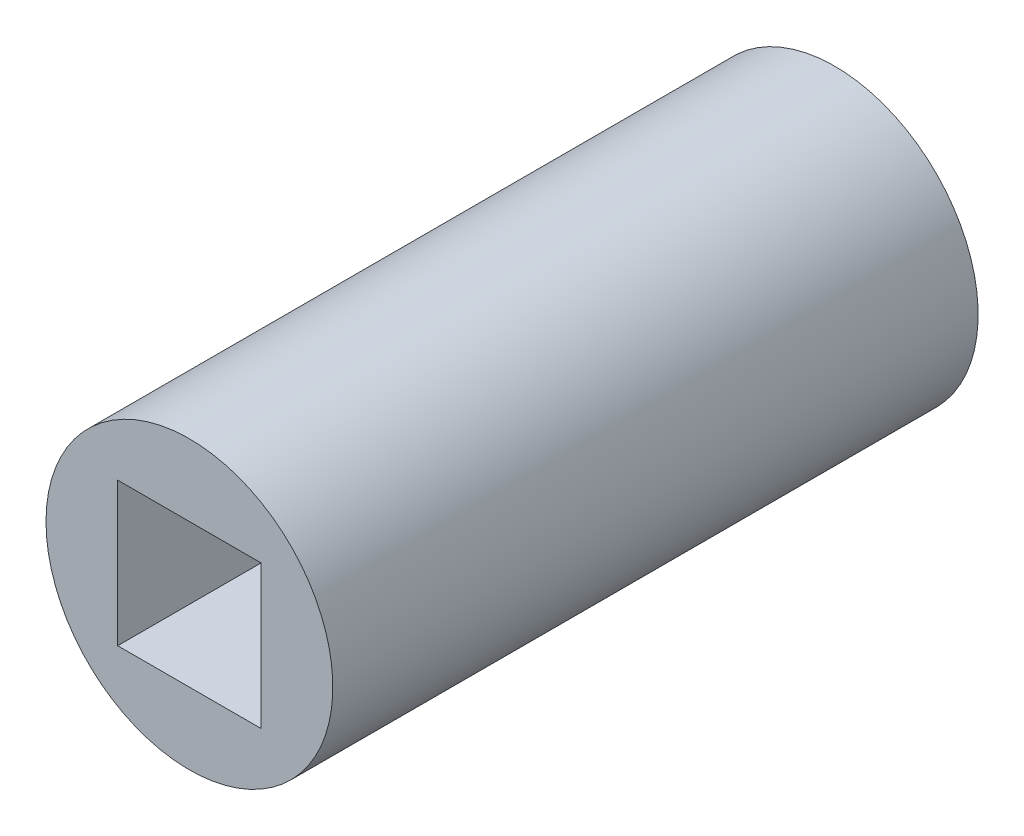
ISO-10303-21;
HEADER;
FILE_DESCRIPTION(('STEP AP214'),'2;1');
FILE_NAME('part.step','',(''),(''),'','','');
FILE_SCHEMA(('AUTOMOTIVE_DESIGN { 1 0 10303 214 1 1 1 1 }'));
ENDSEC;
DATA;
#1=APPLICATION_CONTEXT('core data for automotive mechanical design processes');
#2=APPLICATION_PROTOCOL_DEFINITION('international standard','automotive_design',2000,#1);
#3=PRODUCT_CONTEXT('',#1,'mechanical');
#4=PRODUCT('Part','Part','',(#3));
#5=PRODUCT_RELATED_PRODUCT_CATEGORY('part','',(#4));
#6=PRODUCT_DEFINITION_FORMATION('','',#4);
#7=PRODUCT_DEFINITION_CONTEXT('part definition',#1,'design');
#8=PRODUCT_DEFINITION('design','',#6,#7);
#9=PRODUCT_DEFINITION_SHAPE('','',#8);
#10=(LENGTH_UNIT() NAMED_UNIT(*) SI_UNIT(.MILLI.,.METRE.));
#11=(NAMED_UNIT(*) PLANE_ANGLE_UNIT() SI_UNIT($,.RADIAN.));
#12=(NAMED_UNIT(*) SI_UNIT($,.STERADIAN.) SOLID_ANGLE_UNIT());
#13=UNCERTAINTY_MEASURE_WITH_UNIT(LENGTH_MEASURE(1.E-05),#10,'distance_accuracy_value','');
#14=(GEOMETRIC_REPRESENTATION_CONTEXT(3) GLOBAL_UNCERTAINTY_ASSIGNED_CONTEXT((#13)) GLOBAL_UNIT_ASSIGNED_CONTEXT((#10,
#11,#12)) REPRESENTATION_CONTEXT('',''));
#15=CARTESIAN_POINT('',(0.,0.,0.));
#16=DIRECTION('',(0.,0.,1.));
#17=DIRECTION('',(1.,0.,0.));
#18=AXIS2_PLACEMENT_3D('',#15,#16,#17);
#19=CARTESIAN_POINT('',(0.,0.,45.));
#20=DIRECTION('',(0.,0.,1.));
#21=DIRECTION('',(1.,0.,0.));
#22=AXIS2_PLACEMENT_3D('',#19,#20,#21);
#23=PLANE('',#22);
#24=CARTESIAN_POINT('',(0.,0.,45.));
#25=DIRECTION('',(0.,0.,1.));
#26=DIRECTION('',(1.,0.,0.));
#27=AXIS2_PLACEMENT_3D('',#24,#25,#26);
#28=CIRCLE('',#27,10.);
#29=CARTESIAN_POINT('',(-10.,0.,45.));
#30=VERTEX_POINT('',#29);
#31=EDGE_CURVE('E11',#30,#30,#28,.T.);
#32=ORIENTED_EDGE('',*,*,#31,.T.);
#33=EDGE_LOOP('',(#32));
#34=FACE_BOUND('',#33,.T.);
#35=DIRECTION('',(1.,0.,0.));
#36=VECTOR('',#35,1.);
#37=CARTESIAN_POINT('',(-5.,-5.,45.));
#38=LINE('',#37,#36);
#39=CARTESIAN_POINT('',(-5.,-5.,45.));
#40=VERTEX_POINT('',#39);
#41=CARTESIAN_POINT('',(5.,-5.,45.));
#42=VERTEX_POINT('',#41);
#43=EDGE_CURVE('E86',#40,#42,#38,.T.);
#44=ORIENTED_EDGE('',*,*,#43,.F.);
#45=DIRECTION('',(0.,-1.,0.));
#46=VECTOR('',#45,1.);
#47=CARTESIAN_POINT('',(-5.,5.,45.));
#48=LINE('',#47,#46);
#49=CARTESIAN_POINT('',(-5.,5.,45.));
#50=VERTEX_POINT('',#49);
#51=EDGE_CURVE('E78',#50,#40,#48,.T.);
#52=ORIENTED_EDGE('',*,*,#51,.F.);
#53=DIRECTION('',(-1.,0.,0.));
#54=VECTOR('',#53,1.);
#55=CARTESIAN_POINT('',(-5.,5.,45.));
#56=LINE('',#55,#54);
#57=CARTESIAN_POINT('',(5.,5.,45.));
#58=VERTEX_POINT('',#57);
#59=EDGE_CURVE('E99',#58,#50,#56,.T.);
#60=ORIENTED_EDGE('',*,*,#59,.F.);
#61=DIRECTION('',(0.,1.,0.));
#62=VECTOR('',#61,1.);
#63=CARTESIAN_POINT('',(5.,5.,45.));
#64=LINE('',#63,#62);
#65=EDGE_CURVE('E97',#42,#58,#64,.T.);
#66=ORIENTED_EDGE('',*,*,#65,.F.);
#67=EDGE_LOOP('',(#44,#52,#60,#66));
#68=FACE_BOUND('',#67,.T.);
#69=ADVANCED_FACE('F37',(#34,#68),#23,.T.);
#70=CARTESIAN_POINT('',(0.,0.,0.));
#71=DIRECTION('',(0.,0.,1.));
#72=DIRECTION('',(1.,0.,0.));
#73=AXIS2_PLACEMENT_3D('',#70,#71,#72);
#74=PLANE('',#73);
#75=CARTESIAN_POINT('',(0.,0.,0.));
#76=DIRECTION('',(0.,0.,1.));
#77=DIRECTION('',(1.,0.,0.));
#78=AXIS2_PLACEMENT_3D('',#75,#76,#77);
#79=CIRCLE('',#78,10.);
#80=CARTESIAN_POINT('',(-10.,0.,0.));
#81=VERTEX_POINT('',#80);
#82=EDGE_CURVE('E41',#81,#81,#79,.T.);
#83=ORIENTED_EDGE('',*,*,#82,.F.);
#84=EDGE_LOOP('',(#83));
#85=FACE_BOUND('',#84,.T.);
#86=DIRECTION('',(0.,-1.,0.));
#87=VECTOR('',#86,1.);
#88=CARTESIAN_POINT('',(-5.,5.,0.));
#89=LINE('',#88,#87);
#90=CARTESIAN_POINT('',(-5.,5.,0.));
#91=VERTEX_POINT('',#90);
#92=CARTESIAN_POINT('',(-5.,-5.,0.));
#93=VERTEX_POINT('',#92);
#94=EDGE_CURVE('E60',#91,#93,#89,.T.);
#95=ORIENTED_EDGE('',*,*,#94,.T.);
#96=DIRECTION('',(1.,0.,0.));
#97=VECTOR('',#96,1.);
#98=CARTESIAN_POINT('',(-5.,-5.,0.));
#99=LINE('',#98,#97);
#100=CARTESIAN_POINT('',(5.,-5.,0.));
#101=VERTEX_POINT('',#100);
#102=EDGE_CURVE('E93',#93,#101,#99,.T.);
#103=ORIENTED_EDGE('',*,*,#102,.T.);
#104=DIRECTION('',(0.,1.,0.));
#105=VECTOR('',#104,1.);
#106=CARTESIAN_POINT('',(5.,5.,0.));
#107=LINE('',#106,#105);
#108=CARTESIAN_POINT('',(5.,5.,0.));
#109=VERTEX_POINT('',#108);
#110=EDGE_CURVE('E105',#101,#109,#107,.T.);
#111=ORIENTED_EDGE('',*,*,#110,.T.);
#112=DIRECTION('',(-1.,0.,0.));
#113=VECTOR('',#112,1.);
#114=CARTESIAN_POINT('',(-5.,5.,0.));
#115=LINE('',#114,#113);
#116=EDGE_CURVE('E87',#109,#91,#115,.T.);
#117=ORIENTED_EDGE('',*,*,#116,.T.);
#118=EDGE_LOOP('',(#95,#103,#111,#117));
#119=FACE_BOUND('',#118,.T.);
#120=ADVANCED_FACE('F116',(#85,#119),#74,.F.);
#121=CARTESIAN_POINT('',(0.,0.,45.));
#122=DIRECTION('',(0.,0.,-1.));
#123=DIRECTION('',(-1.,0.,0.));
#124=AXIS2_PLACEMENT_3D('',#121,#122,#123);
#125=CYLINDRICAL_SURFACE('',#124,10.);
#126=CARTESIAN_POINT('',(-10.,0.,45.));
#127=CARTESIAN_POINT('',(-10.,0.,44.53125));
#128=CARTESIAN_POINT('',(-10.,0.,44.0625));
#129=CARTESIAN_POINT('',(-10.,0.,43.125));
#130=CARTESIAN_POINT('',(-10.,0.,42.65625));
#131=CARTESIAN_POINT('',(-10.,0.,41.71875));
#132=CARTESIAN_POINT('',(-10.,0.,41.25));
#133=CARTESIAN_POINT('',(-10.,0.,40.3125));
#134=CARTESIAN_POINT('',(-10.,0.,39.84375));
#135=CARTESIAN_POINT('',(-10.,0.,38.90625));
#136=CARTESIAN_POINT('',(-10.,0.,38.4375));
#137=CARTESIAN_POINT('',(-10.,0.,37.5));
#138=CARTESIAN_POINT('',(-10.,0.,37.03125));
#139=CARTESIAN_POINT('',(-10.,0.,36.09375));
#140=CARTESIAN_POINT('',(-10.,0.,35.625));
#141=CARTESIAN_POINT('',(-10.,0.,34.6875));
#142=CARTESIAN_POINT('',(-10.,0.,34.21875));
#143=CARTESIAN_POINT('',(-10.,0.,33.28125));
#144=CARTESIAN_POINT('',(-10.,0.,32.8125));
#145=CARTESIAN_POINT('',(-10.,0.,31.875));
#146=CARTESIAN_POINT('',(-10.,0.,31.40625));
#147=CARTESIAN_POINT('',(-10.,0.,30.46875));
#148=CARTESIAN_POINT('',(-10.,0.,30.));
#149=CARTESIAN_POINT('',(-10.,0.,29.0625));
#150=CARTESIAN_POINT('',(-10.,0.,28.59375));
#151=CARTESIAN_POINT('',(-10.,0.,27.65625));
#152=CARTESIAN_POINT('',(-10.,0.,27.1875));
#153=CARTESIAN_POINT('',(-10.,0.,26.25));
#154=CARTESIAN_POINT('',(-10.,0.,25.78125));
#155=CARTESIAN_POINT('',(-10.,0.,24.84375));
#156=CARTESIAN_POINT('',(-10.,0.,24.375));
#157=CARTESIAN_POINT('',(-10.,0.,23.4375));
#158=CARTESIAN_POINT('',(-10.,0.,22.96875));
#159=CARTESIAN_POINT('',(-10.,0.,22.03125));
#160=CARTESIAN_POINT('',(-10.,0.,21.5625));
#161=CARTESIAN_POINT('',(-10.,0.,20.625));
#162=CARTESIAN_POINT('',(-10.,0.,20.15625));
#163=CARTESIAN_POINT('',(-10.,0.,19.21875));
#164=CARTESIAN_POINT('',(-10.,0.,18.75));
#165=CARTESIAN_POINT('',(-10.,0.,17.8125));
#166=CARTESIAN_POINT('',(-10.,0.,17.34375));
#167=CARTESIAN_POINT('',(-10.,0.,16.40625));
#168=CARTESIAN_POINT('',(-10.,0.,15.9375));
#169=CARTESIAN_POINT('',(-10.,0.,15.));
#170=CARTESIAN_POINT('',(-10.,0.,14.53125));
#171=CARTESIAN_POINT('',(-10.,0.,13.59375));
#172=CARTESIAN_POINT('',(-10.,0.,13.125));
#173=CARTESIAN_POINT('',(-10.,0.,12.1875));
#174=CARTESIAN_POINT('',(-10.,0.,11.71875));
#175=CARTESIAN_POINT('',(-10.,0.,10.78125));
#176=CARTESIAN_POINT('',(-10.,0.,10.3125));
#177=CARTESIAN_POINT('',(-10.,0.,9.375));
#178=CARTESIAN_POINT('',(-10.,0.,8.90625));
#179=CARTESIAN_POINT('',(-10.,0.,7.96874999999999));
#180=CARTESIAN_POINT('',(-10.,0.,7.5));
#181=CARTESIAN_POINT('',(-10.,0.,6.5625));
#182=CARTESIAN_POINT('',(-10.,0.,6.09375));
#183=CARTESIAN_POINT('',(-10.,0.,5.15625));
#184=CARTESIAN_POINT('',(-10.,0.,4.68749999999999));
#185=CARTESIAN_POINT('',(-10.,0.,3.74999999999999));
#186=CARTESIAN_POINT('',(-10.,0.,3.28124999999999));
#187=CARTESIAN_POINT('',(-10.,0.,2.34374999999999));
#188=CARTESIAN_POINT('',(-10.,0.,1.87499999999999));
#189=CARTESIAN_POINT('',(-10.,0.,0.937499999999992));
#190=CARTESIAN_POINT('',(-10.,0.,0.468749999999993));
#191=CARTESIAN_POINT('',(-10.,0.,0.));
#192=B_SPLINE_CURVE_WITH_KNOTS('',3,(#126,#127,#128,#129,#130,#131,#132,#133,#134,#135,#136,
#137,#138,#139,#140,#141,#142,#143,#144,#145,#146,#147,#148,#149,#150,#151,#152,#153,#154,#155,
#156,#157,#158,#159,#160,#161,#162,#163,#164,#165,#166,#167,#168,#169,#170,#171,#172,#173,#174,
#175,#176,#177,#178,#179,#180,#181,#182,#183,#184,#185,#186,#187,#188,#189,#190,#191),
.UNSPECIFIED.,.F.,.F.,(4,2,2,2,2,2,2,2,2,2,2,2,2,2,2,2,2,2,2,2,2,2,2,2,2,2,2,2,2,2,2,2,4),(0.,
1.40625,2.8125,4.21875000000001,5.62500000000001,7.03125,8.4375,9.84375000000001,11.25,12.65625,
14.0625,15.46875,16.875,18.28125,19.6875,21.09375,22.5,23.90625,25.3125,26.71875,28.125,
29.53125,30.9375,32.34375,33.75,35.15625,36.5625,37.96875,39.375,40.78125,42.1875,43.59375,45.),.UNSPECIFIED.);
#193=EDGE_CURVE('BSEAM39',#30,#81,#192,.T.);
#194=ORIENTED_EDGE('',*,*,#31,.F.);
#195=ORIENTED_EDGE('',*,*,#82,.T.);
#196=ORIENTED_EDGE('',*,*,#193,.T.);
#197=ORIENTED_EDGE('',*,*,#193,.F.);
#198=EDGE_LOOP('',(#194,#196,#195,#197));
#199=FACE_BOUND('',#198,.T.);
#200=ADVANCED_FACE('F39',(#199),#125,.T.);
#201=CARTESIAN_POINT('',(-5.,5.,45.));
#202=DIRECTION('',(1.,0.,0.));
#203=DIRECTION('',(0.,0.,-1.));
#204=AXIS2_PLACEMENT_3D('',#201,#202,#203);
#205=PLANE('',#204);
#206=ORIENTED_EDGE('',*,*,#94,.F.);
#207=DIRECTION('',(0.,0.,-1.));
#208=VECTOR('',#207,1.);
#209=CARTESIAN_POINT('',(-5.,5.,45.));
#210=LINE('',#209,#208);
#211=EDGE_CURVE('E82',#50,#91,#210,.T.);
#212=ORIENTED_EDGE('',*,*,#211,.F.);
#213=ORIENTED_EDGE('',*,*,#51,.T.);
#214=DIRECTION('',(0.,0.,-1.));
#215=VECTOR('',#214,1.);
#216=CARTESIAN_POINT('',(-5.,-5.,45.));
#217=LINE('',#216,#215);
#218=EDGE_CURVE('E81',#40,#93,#217,.T.);
#219=ORIENTED_EDGE('',*,*,#218,.T.);
#220=EDGE_LOOP('',(#206,#212,#213,#219));
#221=FACE_BOUND('',#220,.T.);
#222=ADVANCED_FACE('F80',(#221),#205,.T.);
#223=CARTESIAN_POINT('',(-5.,-5.,45.));
#224=DIRECTION('',(0.,1.,0.));
#225=DIRECTION('',(0.,0.,1.));
#226=AXIS2_PLACEMENT_3D('',#223,#224,#225);
#227=PLANE('',#226);
#228=ORIENTED_EDGE('',*,*,#102,.F.);
#229=ORIENTED_EDGE('',*,*,#218,.F.);
#230=ORIENTED_EDGE('',*,*,#43,.T.);
#231=DIRECTION('',(0.,0.,-1.));
#232=VECTOR('',#231,1.);
#233=CARTESIAN_POINT('',(5.,-5.,45.));
#234=LINE('',#233,#232);
#235=EDGE_CURVE('E94',#42,#101,#234,.T.);
#236=ORIENTED_EDGE('',*,*,#235,.T.);
#237=EDGE_LOOP('',(#228,#229,#230,#236));
#238=FACE_BOUND('',#237,.T.);
#239=ADVANCED_FACE('F90',(#238),#227,.T.);
#240=CARTESIAN_POINT('',(5.,5.,45.));
#241=DIRECTION('',(-1.,0.,0.));
#242=DIRECTION('',(0.,-1.,0.));
#243=AXIS2_PLACEMENT_3D('',#240,#241,#242);
#244=PLANE('',#243);
#245=ORIENTED_EDGE('',*,*,#110,.F.);
#246=ORIENTED_EDGE('',*,*,#235,.F.);
#247=ORIENTED_EDGE('',*,*,#65,.T.);
#248=DIRECTION('',(0.,0.,-1.));
#249=VECTOR('',#248,1.);
#250=CARTESIAN_POINT('',(5.,5.,45.));
#251=LINE('',#250,#249);
#252=EDGE_CURVE('E52',#58,#109,#251,.T.);
#253=ORIENTED_EDGE('',*,*,#252,.T.);
#254=EDGE_LOOP('',(#245,#246,#247,#253));
#255=FACE_BOUND('',#254,.T.);
#256=ADVANCED_FACE('F114',(#255),#244,.T.);
#257=CARTESIAN_POINT('',(-5.,5.,45.));
#258=DIRECTION('',(0.,-1.,0.));
#259=DIRECTION('',(0.,0.,-1.));
#260=AXIS2_PLACEMENT_3D('',#257,#258,#259);
#261=PLANE('',#260);
#262=ORIENTED_EDGE('',*,*,#116,.F.);
#263=ORIENTED_EDGE('',*,*,#252,.F.);
#264=ORIENTED_EDGE('',*,*,#59,.T.);
#265=ORIENTED_EDGE('',*,*,#211,.T.);
#266=EDGE_LOOP('',(#262,#263,#264,#265));
#267=FACE_BOUND('',#266,.T.);
#268=ADVANCED_FACE('F117',(#267),#261,.T.);
#269=CLOSED_SHELL('',(#69,#120,#200,#222,#239,#256,#268));
#270=MANIFOLD_SOLID_BREP('B2',#269);
#271=ADVANCED_BREP_SHAPE_REPRESENTATION('',(#18,#270),#14);
#272=SHAPE_DEFINITION_REPRESENTATION(#9,#271);
ENDSEC;
END-ISO-10303-21;
